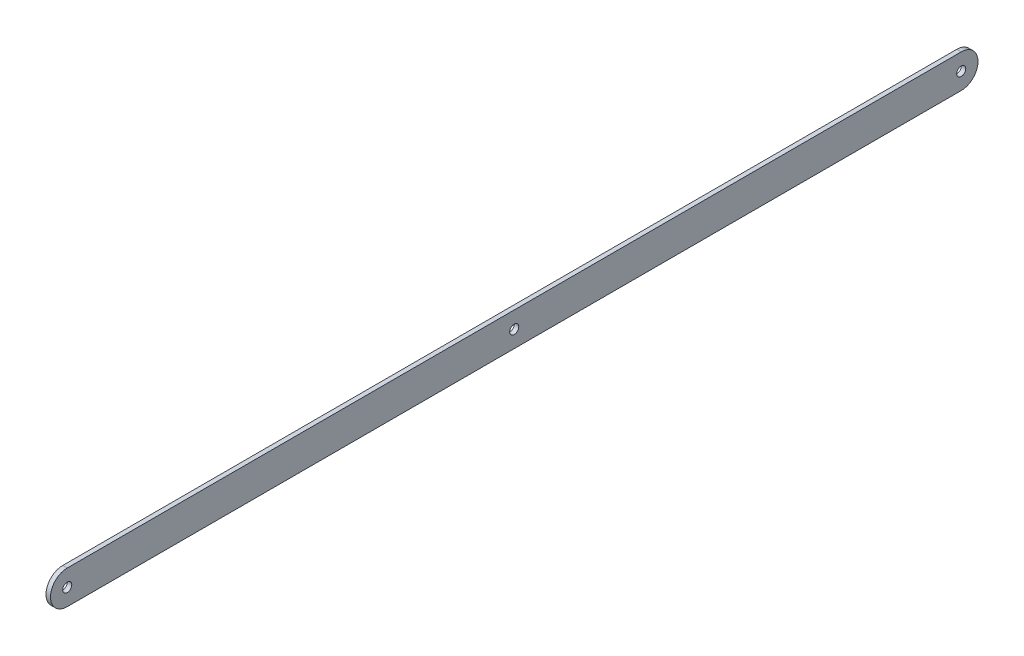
ISO-10303-21;
HEADER;
FILE_DESCRIPTION(('STEP AP214'),'2;1');
FILE_NAME('part.step','',(''),(''),'','','');
FILE_SCHEMA(('AUTOMOTIVE_DESIGN { 1 0 10303 214 1 1 1 1 }'));
ENDSEC;
DATA;
#1=APPLICATION_CONTEXT('core data for automotive mechanical design processes');
#2=APPLICATION_PROTOCOL_DEFINITION('international standard','automotive_design',2000,#1);
#3=PRODUCT_CONTEXT('',#1,'mechanical');
#4=PRODUCT('Part','Part','',(#3));
#5=PRODUCT_RELATED_PRODUCT_CATEGORY('part','',(#4));
#6=PRODUCT_DEFINITION_FORMATION('','',#4);
#7=PRODUCT_DEFINITION_CONTEXT('part definition',#1,'design');
#8=PRODUCT_DEFINITION('design','',#6,#7);
#9=PRODUCT_DEFINITION_SHAPE('','',#8);
#10=(LENGTH_UNIT() NAMED_UNIT(*) SI_UNIT(.MILLI.,.METRE.));
#11=(NAMED_UNIT(*) PLANE_ANGLE_UNIT() SI_UNIT($,.RADIAN.));
#12=(NAMED_UNIT(*) SI_UNIT($,.STERADIAN.) SOLID_ANGLE_UNIT());
#13=UNCERTAINTY_MEASURE_WITH_UNIT(LENGTH_MEASURE(1.E-05),#10,'distance_accuracy_value','');
#14=(GEOMETRIC_REPRESENTATION_CONTEXT(3) GLOBAL_UNCERTAINTY_ASSIGNED_CONTEXT((#13)) GLOBAL_UNIT_ASSIGNED_CONTEXT((#10,
#11,#12)) REPRESENTATION_CONTEXT('',''));
#15=CARTESIAN_POINT('',(0.,0.,0.));
#16=DIRECTION('',(0.,0.,1.));
#17=DIRECTION('',(1.,0.,0.));
#18=AXIS2_PLACEMENT_3D('',#15,#16,#17);
#19=CARTESIAN_POINT('',(4.,0.,-400.));
#20=DIRECTION('',(1.,0.,0.));
#21=DIRECTION('',(0.,0.,-1.));
#22=AXIS2_PLACEMENT_3D('',#19,#20,#21);
#23=PLANE('',#22);
#24=CARTESIAN_POINT('',(4.,-2.66453525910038E-12,400.000000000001));
#25=DIRECTION('',(1.,0.,0.));
#26=DIRECTION('',(0.,0.,-1.));
#27=AXIS2_PLACEMENT_3D('',#24,#25,#26);
#28=CIRCLE('',#27,4.0499999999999);
#29=CARTESIAN_POINT('',(4.,-2.66453525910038E-12,395.950000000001));
#30=VERTEX_POINT('',#29);
#31=EDGE_CURVE('E114',#30,#30,#28,.T.);
#32=ORIENTED_EDGE('',*,*,#31,.F.);
#33=EDGE_LOOP('',(#32));
#34=FACE_BOUND('',#33,.T.);
#35=CARTESIAN_POINT('',(4.,0.,-400.));
#36=DIRECTION('',(1.,0.,0.));
#37=DIRECTION('',(0.,0.,-1.));
#38=AXIS2_PLACEMENT_3D('',#35,#36,#37);
#39=CIRCLE('',#38,15.);
#40=CARTESIAN_POINT('',(4.,-15.0000000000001,-400.));
#41=VERTEX_POINT('',#40);
#42=CARTESIAN_POINT('',(4.,14.9999999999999,-400.));
#43=VERTEX_POINT('',#42);
#44=EDGE_CURVE('E84',#41,#43,#39,.T.);
#45=ORIENTED_EDGE('',*,*,#44,.T.);
#46=DIRECTION('',(0.,0.,1.));
#47=VECTOR('',#46,1.);
#48=CARTESIAN_POINT('',(4.,15.0000000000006,400.000000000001));
#49=LINE('',#48,#47);
#50=CARTESIAN_POINT('',(4.,15.0000000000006,400.000000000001));
#51=VERTEX_POINT('',#50);
#52=EDGE_CURVE('E79',#43,#51,#49,.T.);
#53=ORIENTED_EDGE('',*,*,#52,.T.);
#54=CARTESIAN_POINT('',(4.,-2.66453525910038E-12,400.000000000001));
#55=DIRECTION('',(1.,0.,0.));
#56=DIRECTION('',(0.,0.,-1.));
#57=AXIS2_PLACEMENT_3D('',#54,#55,#56);
#58=CIRCLE('',#57,15.0000000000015);
#59=CARTESIAN_POINT('',(4.,-15.0000000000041,400.000000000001));
#60=VERTEX_POINT('',#59);
#61=EDGE_CURVE('E82',#51,#60,#58,.T.);
#62=ORIENTED_EDGE('',*,*,#61,.T.);
#63=DIRECTION('',(0.,0.,-1.));
#64=VECTOR('',#63,1.);
#65=CARTESIAN_POINT('',(4.,-15.0000000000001,-400.));
#66=LINE('',#65,#64);
#67=EDGE_CURVE('E49',#60,#41,#66,.T.);
#68=ORIENTED_EDGE('',*,*,#67,.T.);
#69=EDGE_LOOP('',(#45,#53,#62,#68));
#70=FACE_BOUND('',#69,.T.);
#71=CARTESIAN_POINT('',(4.,0.,-400.));
#72=DIRECTION('',(1.,0.,0.));
#73=DIRECTION('',(0.,0.,-1.));
#74=AXIS2_PLACEMENT_3D('',#71,#72,#73);
#75=CIRCLE('',#74,4.0499999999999);
#76=CARTESIAN_POINT('',(4.,0.,-404.05));
#77=VERTEX_POINT('',#76);
#78=EDGE_CURVE('E99',#77,#77,#75,.T.);
#79=ORIENTED_EDGE('',*,*,#78,.F.);
#80=EDGE_LOOP('',(#79));
#81=FACE_BOUND('',#80,.T.);
#82=CARTESIAN_POINT('',(4.,0.,0.));
#83=DIRECTION('',(1.,0.,0.));
#84=DIRECTION('',(0.,0.,-1.));
#85=AXIS2_PLACEMENT_3D('',#82,#83,#84);
#86=CIRCLE('',#85,4.0500000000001);
#87=CARTESIAN_POINT('',(4.,0.,-4.0500000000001));
#88=VERTEX_POINT('',#87);
#89=EDGE_CURVE('E120',#88,#88,#86,.T.);
#90=ORIENTED_EDGE('',*,*,#89,.F.);
#91=EDGE_LOOP('',(#90));
#92=FACE_BOUND('',#91,.T.);
#93=ADVANCED_FACE('F32',(#34,#70,#81,#92),#23,.T.);
#94=CARTESIAN_POINT('',(0.,0.,-400.));
#95=DIRECTION('',(1.,0.,0.));
#96=DIRECTION('',(0.,0.,-1.));
#97=AXIS2_PLACEMENT_3D('',#94,#95,#96);
#98=PLANE('',#97);
#99=CARTESIAN_POINT('',(0.,-2.66453525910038E-12,400.000000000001));
#100=DIRECTION('',(1.,0.,0.));
#101=DIRECTION('',(0.,0.,-1.));
#102=AXIS2_PLACEMENT_3D('',#99,#100,#101);
#103=CIRCLE('',#102,4.0499999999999);
#104=CARTESIAN_POINT('',(0.,-2.66453525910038E-12,395.950000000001));
#105=VERTEX_POINT('',#104);
#106=EDGE_CURVE('E117',#105,#105,#103,.T.);
#107=ORIENTED_EDGE('',*,*,#106,.T.);
#108=EDGE_LOOP('',(#107));
#109=FACE_BOUND('',#108,.T.);
#110=CARTESIAN_POINT('',(0.,0.,-400.));
#111=DIRECTION('',(1.,0.,0.));
#112=DIRECTION('',(0.,0.,-1.));
#113=AXIS2_PLACEMENT_3D('',#110,#111,#112);
#114=CIRCLE('',#113,15.);
#115=CARTESIAN_POINT('',(0.,-15.0000000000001,-400.));
#116=VERTEX_POINT('',#115);
#117=CARTESIAN_POINT('',(0.,14.9999999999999,-400.));
#118=VERTEX_POINT('',#117);
#119=EDGE_CURVE('E96',#116,#118,#114,.T.);
#120=ORIENTED_EDGE('',*,*,#119,.F.);
#121=DIRECTION('',(0.,0.,-1.));
#122=VECTOR('',#121,1.);
#123=CARTESIAN_POINT('',(0.,-15.0000000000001,-400.));
#124=LINE('',#123,#122);
#125=CARTESIAN_POINT('',(0.,-15.0000000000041,400.000000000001));
#126=VERTEX_POINT('',#125);
#127=EDGE_CURVE('E72',#126,#116,#124,.T.);
#128=ORIENTED_EDGE('',*,*,#127,.F.);
#129=CARTESIAN_POINT('',(0.,-2.66453525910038E-12,400.000000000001));
#130=DIRECTION('',(1.,0.,0.));
#131=DIRECTION('',(0.,0.,-1.));
#132=AXIS2_PLACEMENT_3D('',#129,#130,#131);
#133=CIRCLE('',#132,15.0000000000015);
#134=CARTESIAN_POINT('',(0.,15.0000000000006,400.000000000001));
#135=VERTEX_POINT('',#134);
#136=EDGE_CURVE('E66',#135,#126,#133,.T.);
#137=ORIENTED_EDGE('',*,*,#136,.F.);
#138=DIRECTION('',(0.,0.,1.));
#139=VECTOR('',#138,1.);
#140=CARTESIAN_POINT('',(0.,15.0000000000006,400.000000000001));
#141=LINE('',#140,#139);
#142=EDGE_CURVE('E88',#118,#135,#141,.T.);
#143=ORIENTED_EDGE('',*,*,#142,.F.);
#144=EDGE_LOOP('',(#120,#128,#137,#143));
#145=FACE_BOUND('',#144,.T.);
#146=CARTESIAN_POINT('',(0.,0.,-400.));
#147=DIRECTION('',(1.,0.,0.));
#148=DIRECTION('',(0.,0.,-1.));
#149=AXIS2_PLACEMENT_3D('',#146,#147,#148);
#150=CIRCLE('',#149,4.0499999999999);
#151=CARTESIAN_POINT('',(0.,0.,-404.05));
#152=VERTEX_POINT('',#151);
#153=EDGE_CURVE('E111',#152,#152,#150,.T.);
#154=ORIENTED_EDGE('',*,*,#153,.T.);
#155=EDGE_LOOP('',(#154));
#156=FACE_BOUND('',#155,.T.);
#157=CARTESIAN_POINT('',(0.,0.,0.));
#158=DIRECTION('',(1.,0.,0.));
#159=DIRECTION('',(0.,0.,-1.));
#160=AXIS2_PLACEMENT_3D('',#157,#158,#159);
#161=CIRCLE('',#160,4.0500000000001);
#162=CARTESIAN_POINT('',(0.,0.,-4.0500000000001));
#163=VERTEX_POINT('',#162);
#164=EDGE_CURVE('E123',#163,#163,#161,.T.);
#165=ORIENTED_EDGE('',*,*,#164,.T.);
#166=EDGE_LOOP('',(#165));
#167=FACE_BOUND('',#166,.T.);
#168=ADVANCED_FACE('F107',(#109,#145,#156,#167),#98,.F.);
#169=CARTESIAN_POINT('',(4.,0.,-400.));
#170=DIRECTION('',(-1.,0.,0.));
#171=DIRECTION('',(0.,0.,1.));
#172=AXIS2_PLACEMENT_3D('',#169,#170,#171);
#173=CYLINDRICAL_SURFACE('',#172,15.);
#174=ORIENTED_EDGE('',*,*,#119,.T.);
#175=DIRECTION('',(-1.,0.,0.));
#176=VECTOR('',#175,1.);
#177=CARTESIAN_POINT('',(4.,14.9999999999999,-400.));
#178=LINE('',#177,#176);
#179=EDGE_CURVE('E11',#43,#118,#178,.T.);
#180=ORIENTED_EDGE('',*,*,#179,.F.);
#181=ORIENTED_EDGE('',*,*,#44,.F.);
#182=DIRECTION('',(-1.,0.,0.));
#183=VECTOR('',#182,1.);
#184=CARTESIAN_POINT('',(4.,-15.0000000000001,-400.));
#185=LINE('',#184,#183);
#186=EDGE_CURVE('E92',#41,#116,#185,.T.);
#187=ORIENTED_EDGE('',*,*,#186,.T.);
#188=EDGE_LOOP('',(#174,#180,#181,#187));
#189=FACE_BOUND('',#188,.T.);
#190=ADVANCED_FACE('F34',(#189),#173,.T.);
#191=CARTESIAN_POINT('',(4.,15.0000000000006,400.000000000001));
#192=DIRECTION('',(0.,-1.,0.));
#193=DIRECTION('',(0.,0.,-1.));
#194=AXIS2_PLACEMENT_3D('',#191,#192,#193);
#195=PLANE('',#194);
#196=ORIENTED_EDGE('',*,*,#142,.T.);
#197=DIRECTION('',(-1.,0.,0.));
#198=VECTOR('',#197,1.);
#199=CARTESIAN_POINT('',(4.,15.0000000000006,400.000000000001));
#200=LINE('',#199,#198);
#201=EDGE_CURVE('E41',#51,#135,#200,.T.);
#202=ORIENTED_EDGE('',*,*,#201,.F.);
#203=ORIENTED_EDGE('',*,*,#52,.F.);
#204=ORIENTED_EDGE('',*,*,#179,.T.);
#205=EDGE_LOOP('',(#196,#202,#203,#204));
#206=FACE_BOUND('',#205,.T.);
#207=ADVANCED_FACE('F87',(#206),#195,.F.);
#208=CARTESIAN_POINT('',(4.,-2.66453525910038E-12,400.000000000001));
#209=DIRECTION('',(-1.,0.,0.));
#210=DIRECTION('',(0.,0.,1.));
#211=AXIS2_PLACEMENT_3D('',#208,#209,#210);
#212=CYLINDRICAL_SURFACE('',#211,15.0000000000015);
#213=ORIENTED_EDGE('',*,*,#136,.T.);
#214=DIRECTION('',(-1.,0.,0.));
#215=VECTOR('',#214,1.);
#216=CARTESIAN_POINT('',(4.,-15.0000000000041,400.000000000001));
#217=LINE('',#216,#215);
#218=EDGE_CURVE('E89',#60,#126,#217,.T.);
#219=ORIENTED_EDGE('',*,*,#218,.F.);
#220=ORIENTED_EDGE('',*,*,#61,.F.);
#221=ORIENTED_EDGE('',*,*,#201,.T.);
#222=EDGE_LOOP('',(#213,#219,#220,#221));
#223=FACE_BOUND('',#222,.T.);
#224=ADVANCED_FACE('F90',(#223),#212,.T.);
#225=CARTESIAN_POINT('',(4.,-15.0000000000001,-400.));
#226=DIRECTION('',(0.,1.,0.));
#227=DIRECTION('',(0.,0.,1.));
#228=AXIS2_PLACEMENT_3D('',#225,#226,#227);
#229=PLANE('',#228);
#230=ORIENTED_EDGE('',*,*,#127,.T.);
#231=ORIENTED_EDGE('',*,*,#186,.F.);
#232=ORIENTED_EDGE('',*,*,#67,.F.);
#233=ORIENTED_EDGE('',*,*,#218,.T.);
#234=EDGE_LOOP('',(#230,#231,#232,#233));
#235=FACE_BOUND('',#234,.T.);
#236=ADVANCED_FACE('F104',(#235),#229,.F.);
#237=CARTESIAN_POINT('',(4.,0.,-400.));
#238=DIRECTION('',(-1.,0.,0.));
#239=DIRECTION('',(0.,0.,1.));
#240=AXIS2_PLACEMENT_3D('',#237,#238,#239);
#241=CYLINDRICAL_SURFACE('',#240,4.0499999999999);
#242=ORIENTED_EDGE('',*,*,#78,.T.);
#243=EDGE_LOOP('',(#242));
#244=FACE_BOUND('',#243,.T.);
#245=ORIENTED_EDGE('',*,*,#153,.F.);
#246=EDGE_LOOP('',(#245));
#247=FACE_BOUND('',#246,.T.);
#248=ADVANCED_FACE('F142',(#244,#247),#241,.F.);
#249=CARTESIAN_POINT('',(4.,-2.66453525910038E-12,400.000000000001));
#250=DIRECTION('',(-1.,0.,0.));
#251=DIRECTION('',(0.,0.,1.));
#252=AXIS2_PLACEMENT_3D('',#249,#250,#251);
#253=CYLINDRICAL_SURFACE('',#252,4.0499999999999);
#254=ORIENTED_EDGE('',*,*,#31,.T.);
#255=EDGE_LOOP('',(#254));
#256=FACE_BOUND('',#255,.T.);
#257=ORIENTED_EDGE('',*,*,#106,.F.);
#258=EDGE_LOOP('',(#257));
#259=FACE_BOUND('',#258,.T.);
#260=ADVANCED_FACE('F188',(#256,#259),#253,.F.);
#261=CARTESIAN_POINT('',(4.,0.,0.));
#262=DIRECTION('',(-1.,0.,0.));
#263=DIRECTION('',(0.,0.,1.));
#264=AXIS2_PLACEMENT_3D('',#261,#262,#263);
#265=CYLINDRICAL_SURFACE('',#264,4.0500000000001);
#266=ORIENTED_EDGE('',*,*,#89,.T.);
#267=EDGE_LOOP('',(#266));
#268=FACE_BOUND('',#267,.T.);
#269=ORIENTED_EDGE('',*,*,#164,.F.);
#270=EDGE_LOOP('',(#269));
#271=FACE_BOUND('',#270,.T.);
#272=ADVANCED_FACE('F129',(#268,#271),#265,.F.);
#273=CLOSED_SHELL('',(#93,#168,#190,#207,#224,#236,#248,#260,#272));
#274=MANIFOLD_SOLID_BREP('B2',#273);
#275=ADVANCED_BREP_SHAPE_REPRESENTATION('',(#18,#274),#14);
#276=SHAPE_DEFINITION_REPRESENTATION(#9,#275);
ENDSEC;
END-ISO-10303-21;
